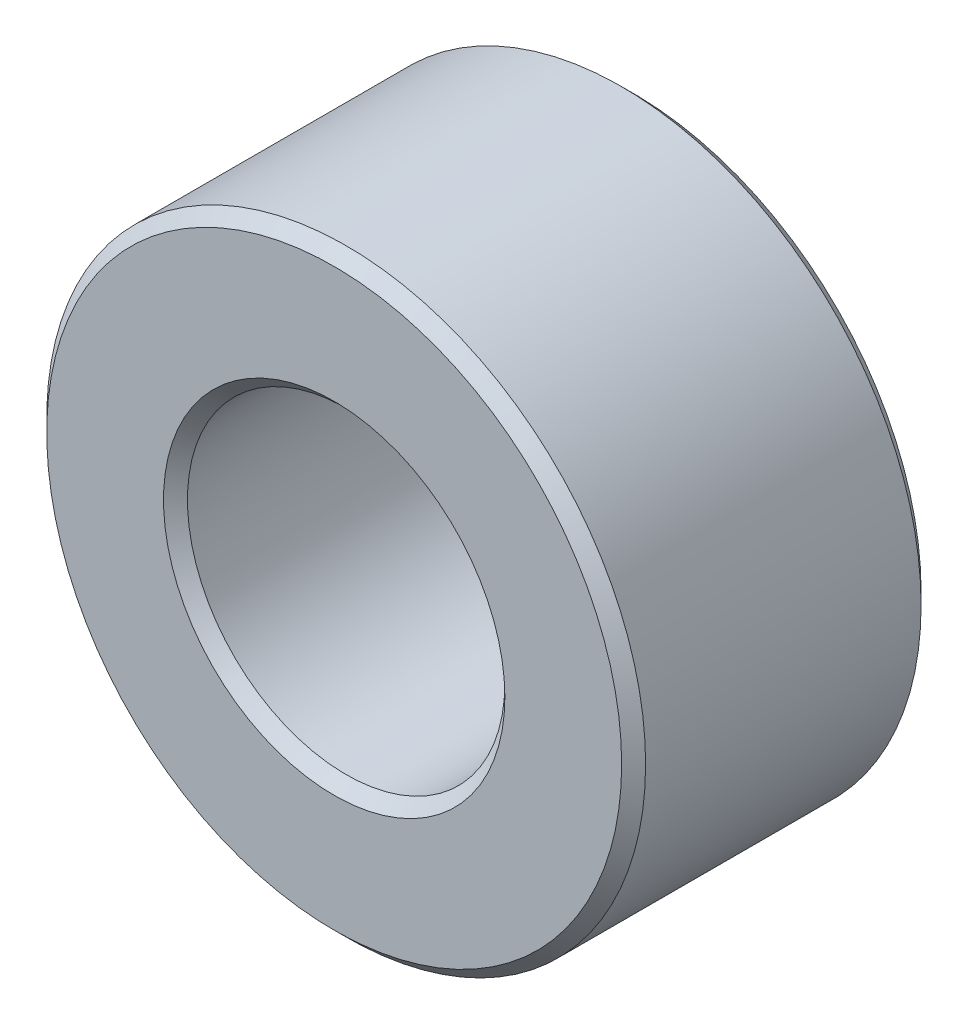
from build123d import *

# Parameters (mm, degrees)
SKETCH1_R           = 5
SKETCH1_R_2         = 2.65
BOSS_EXTRUDE2_DEPTH = 2.5
CHAMFER3_SIZE       = 0.2


with BuildPart() as part:
    # Sketch1 → Boss-Extrude2 (new, symmetric)
    with BuildSketch(Plane.XY):
        Circle(SKETCH1_R)
        Circle(SKETCH1_R_2, mode=Mode.SUBTRACT)
    extrude(amount=BOSS_EXTRUDE2_DEPTH, both=True)

    # Chamfer3
    chamfer3_edges = [part.edges().sort_by_distance(p)[0] for p in [
        (-5, 0, -2.5),
        (-5, 0, 2.5),
        (-2.65, 0, -2.5),
        (-2.65, 0, 2.5),
    ]]
    chamfer(chamfer3_edges, length=CHAMFER3_SIZE)


solid = part.part
